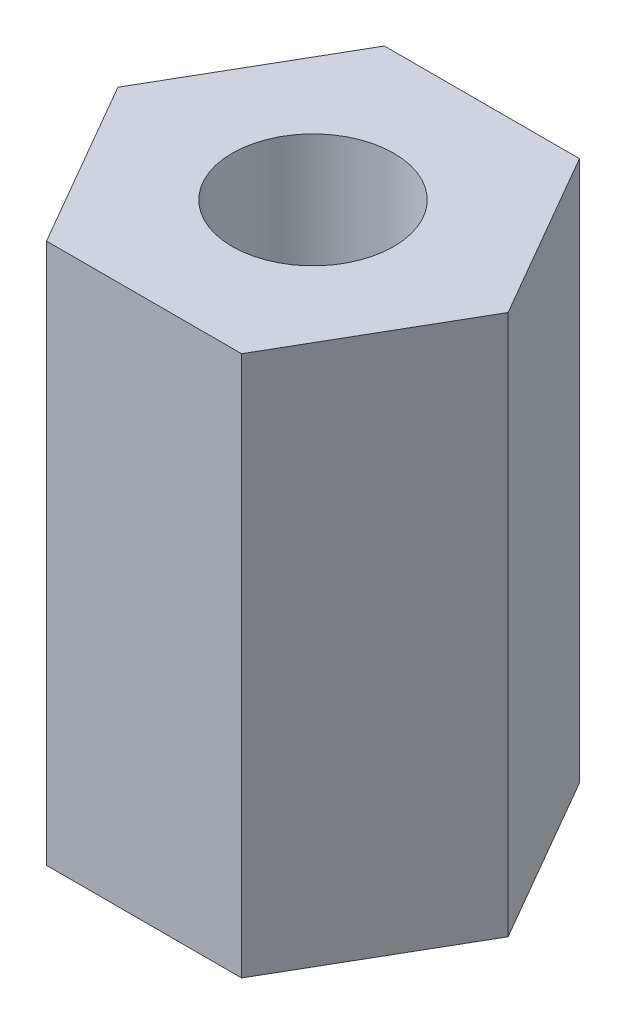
ISO-10303-21;
HEADER;
FILE_DESCRIPTION(('STEP AP214'),'2;1');
FILE_NAME('part.step','',(''),(''),'','','');
FILE_SCHEMA(('AUTOMOTIVE_DESIGN { 1 0 10303 214 1 1 1 1 }'));
ENDSEC;
DATA;
#1=APPLICATION_CONTEXT('core data for automotive mechanical design processes');
#2=APPLICATION_PROTOCOL_DEFINITION('international standard','automotive_design',2000,#1);
#3=PRODUCT_CONTEXT('',#1,'mechanical');
#4=PRODUCT('Part','Part','',(#3));
#5=PRODUCT_RELATED_PRODUCT_CATEGORY('part','',(#4));
#6=PRODUCT_DEFINITION_FORMATION('','',#4);
#7=PRODUCT_DEFINITION_CONTEXT('part definition',#1,'design');
#8=PRODUCT_DEFINITION('design','',#6,#7);
#9=PRODUCT_DEFINITION_SHAPE('','',#8);
#10=(LENGTH_UNIT() NAMED_UNIT(*) SI_UNIT(.MILLI.,.METRE.));
#11=(NAMED_UNIT(*) PLANE_ANGLE_UNIT() SI_UNIT($,.RADIAN.));
#12=(NAMED_UNIT(*) SI_UNIT($,.STERADIAN.) SOLID_ANGLE_UNIT());
#13=UNCERTAINTY_MEASURE_WITH_UNIT(LENGTH_MEASURE(1.E-05),#10,'distance_accuracy_value','');
#14=(GEOMETRIC_REPRESENTATION_CONTEXT(3) GLOBAL_UNCERTAINTY_ASSIGNED_CONTEXT((#13)) GLOBAL_UNIT_ASSIGNED_CONTEXT((#10,
#11,#12)) REPRESENTATION_CONTEXT('',''));
#15=CARTESIAN_POINT('',(0.,0.,0.));
#16=DIRECTION('',(0.,0.,1.));
#17=DIRECTION('',(1.,0.,0.));
#18=AXIS2_PLACEMENT_3D('',#15,#16,#17);
#19=CARTESIAN_POINT('',(-4.58271776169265,12.7,0.));
#20=DIRECTION('',(0.866025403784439,0.,0.5));
#21=DIRECTION('',(0.5,0.,-0.866025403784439));
#22=AXIS2_PLACEMENT_3D('',#19,#20,#21);
#23=PLANE('',#22);
#24=DIRECTION('',(-0.5,0.,0.866025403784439));
#25=VECTOR('',#24,1.);
#26=CARTESIAN_POINT('',(-4.58271776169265,0.,0.));
#27=LINE('',#26,#25);
#28=CARTESIAN_POINT('',(-2.29135888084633,0.,-3.96875));
#29=VERTEX_POINT('',#28);
#30=CARTESIAN_POINT('',(-4.58271776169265,0.,0.));
#31=VERTEX_POINT('',#30);
#32=EDGE_CURVE('E119',#29,#31,#27,.T.);
#33=ORIENTED_EDGE('',*,*,#32,.T.);
#34=DIRECTION('',(0.,-1.,0.));
#35=VECTOR('',#34,1.);
#36=CARTESIAN_POINT('',(-4.58271776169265,12.7,0.));
#37=LINE('',#36,#35);
#38=CARTESIAN_POINT('',(-4.58271776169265,12.7,0.));
#39=VERTEX_POINT('',#38);
#40=EDGE_CURVE('E11',#39,#31,#37,.T.);
#41=ORIENTED_EDGE('',*,*,#40,.F.);
#42=DIRECTION('',(-0.5,0.,0.866025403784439));
#43=VECTOR('',#42,1.);
#44=CARTESIAN_POINT('',(-4.58271776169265,12.7,0.));
#45=LINE('',#44,#43);
#46=CARTESIAN_POINT('',(-2.29135888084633,12.7,-3.96875));
#47=VERTEX_POINT('',#46);
#48=EDGE_CURVE('E130',#47,#39,#45,.T.);
#49=ORIENTED_EDGE('',*,*,#48,.F.);
#50=DIRECTION('',(0.,-1.,0.));
#51=VECTOR('',#50,1.);
#52=CARTESIAN_POINT('',(-2.29135888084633,12.7,-3.96875));
#53=LINE('',#52,#51);
#54=EDGE_CURVE('E115',#47,#29,#53,.T.);
#55=ORIENTED_EDGE('',*,*,#54,.T.);
#56=EDGE_LOOP('',(#33,#41,#49,#55));
#57=FACE_BOUND('',#56,.T.);
#58=ADVANCED_FACE('F35',(#57),#23,.F.);
#59=CARTESIAN_POINT('',(-2.29135888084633,12.7,3.96875));
#60=DIRECTION('',(0.866025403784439,0.,-0.5));
#61=DIRECTION('',(-0.5,0.,-0.866025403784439));
#62=AXIS2_PLACEMENT_3D('',#59,#60,#61);
#63=PLANE('',#62);
#64=DIRECTION('',(0.5,0.,0.866025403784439));
#65=VECTOR('',#64,1.);
#66=CARTESIAN_POINT('',(-2.29135888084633,0.,3.96875));
#67=LINE('',#66,#65);
#68=CARTESIAN_POINT('',(-2.29135888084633,0.,3.96875));
#69=VERTEX_POINT('',#68);
#70=EDGE_CURVE('E122',#31,#69,#67,.T.);
#71=ORIENTED_EDGE('',*,*,#70,.T.);
#72=DIRECTION('',(0.,-1.,0.));
#73=VECTOR('',#72,1.);
#74=CARTESIAN_POINT('',(-2.29135888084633,12.7,3.96875));
#75=LINE('',#74,#73);
#76=CARTESIAN_POINT('',(-2.29135888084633,12.7,3.96875));
#77=VERTEX_POINT('',#76);
#78=EDGE_CURVE('E43',#77,#69,#75,.T.);
#79=ORIENTED_EDGE('',*,*,#78,.F.);
#80=DIRECTION('',(0.5,0.,0.866025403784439));
#81=VECTOR('',#80,1.);
#82=CARTESIAN_POINT('',(-2.29135888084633,12.7,3.96875));
#83=LINE('',#82,#81);
#84=EDGE_CURVE('E88',#39,#77,#83,.T.);
#85=ORIENTED_EDGE('',*,*,#84,.F.);
#86=ORIENTED_EDGE('',*,*,#40,.T.);
#87=EDGE_LOOP('',(#71,#79,#85,#86));
#88=FACE_BOUND('',#87,.T.);
#89=ADVANCED_FACE('F155',(#88),#63,.F.);
#90=CARTESIAN_POINT('',(2.29135888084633,12.7,3.96875));
#91=DIRECTION('',(0.,0.,-1.));
#92=DIRECTION('',(-1.,0.,0.));
#93=AXIS2_PLACEMENT_3D('',#90,#91,#92);
#94=PLANE('',#93);
#95=DIRECTION('',(1.,0.,0.));
#96=VECTOR('',#95,1.);
#97=CARTESIAN_POINT('',(2.29135888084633,0.,3.96875));
#98=LINE('',#97,#96);
#99=CARTESIAN_POINT('',(2.29135888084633,0.,3.96875));
#100=VERTEX_POINT('',#99);
#101=EDGE_CURVE('E125',#69,#100,#98,.T.);
#102=ORIENTED_EDGE('',*,*,#101,.T.);
#103=DIRECTION('',(0.,-1.,0.));
#104=VECTOR('',#103,1.);
#105=CARTESIAN_POINT('',(2.29135888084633,12.7,3.96875));
#106=LINE('',#105,#104);
#107=CARTESIAN_POINT('',(2.29135888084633,12.7,3.96875));
#108=VERTEX_POINT('',#107);
#109=EDGE_CURVE('E110',#108,#100,#106,.T.);
#110=ORIENTED_EDGE('',*,*,#109,.F.);
#111=DIRECTION('',(1.,0.,0.));
#112=VECTOR('',#111,1.);
#113=CARTESIAN_POINT('',(2.29135888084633,12.7,3.96875));
#114=LINE('',#113,#112);
#115=EDGE_CURVE('E101',#77,#108,#114,.T.);
#116=ORIENTED_EDGE('',*,*,#115,.F.);
#117=ORIENTED_EDGE('',*,*,#78,.T.);
#118=EDGE_LOOP('',(#102,#110,#116,#117));
#119=FACE_BOUND('',#118,.T.);
#120=ADVANCED_FACE('F136',(#119),#94,.F.);
#121=CARTESIAN_POINT('',(4.58271776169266,12.7,0.));
#122=DIRECTION('',(-0.866025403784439,0.,-0.5));
#123=DIRECTION('',(-0.5,0.,0.866025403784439));
#124=AXIS2_PLACEMENT_3D('',#121,#122,#123);
#125=PLANE('',#124);
#126=DIRECTION('',(0.5,0.,-0.866025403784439));
#127=VECTOR('',#126,1.);
#128=CARTESIAN_POINT('',(4.58271776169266,0.,0.));
#129=LINE('',#128,#127);
#130=CARTESIAN_POINT('',(4.58271776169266,0.,0.));
#131=VERTEX_POINT('',#130);
#132=EDGE_CURVE('E109',#100,#131,#129,.T.);
#133=ORIENTED_EDGE('',*,*,#132,.T.);
#134=DIRECTION('',(0.,-1.,0.));
#135=VECTOR('',#134,1.);
#136=CARTESIAN_POINT('',(4.58271776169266,12.7,0.));
#137=LINE('',#136,#135);
#138=CARTESIAN_POINT('',(4.58271776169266,12.7,0.));
#139=VERTEX_POINT('',#138);
#140=EDGE_CURVE('E106',#139,#131,#137,.T.);
#141=ORIENTED_EDGE('',*,*,#140,.F.);
#142=DIRECTION('',(0.5,0.,-0.866025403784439));
#143=VECTOR('',#142,1.);
#144=CARTESIAN_POINT('',(4.58271776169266,12.7,0.));
#145=LINE('',#144,#143);
#146=EDGE_CURVE('E95',#108,#139,#145,.T.);
#147=ORIENTED_EDGE('',*,*,#146,.F.);
#148=ORIENTED_EDGE('',*,*,#109,.T.);
#149=EDGE_LOOP('',(#133,#141,#147,#148));
#150=FACE_BOUND('',#149,.T.);
#151=ADVANCED_FACE('F107',(#150),#125,.F.);
#152=CARTESIAN_POINT('',(2.29135888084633,12.7,-3.96875));
#153=DIRECTION('',(-0.866025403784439,0.,0.5));
#154=DIRECTION('',(0.5,0.,0.866025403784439));
#155=AXIS2_PLACEMENT_3D('',#152,#153,#154);
#156=PLANE('',#155);
#157=DIRECTION('',(-0.5,0.,-0.866025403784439));
#158=VECTOR('',#157,1.);
#159=CARTESIAN_POINT('',(2.29135888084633,0.,-3.96875));
#160=LINE('',#159,#158);
#161=CARTESIAN_POINT('',(2.29135888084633,0.,-3.96875));
#162=VERTEX_POINT('',#161);
#163=EDGE_CURVE('E74',#131,#162,#160,.T.);
#164=ORIENTED_EDGE('',*,*,#163,.T.);
#165=DIRECTION('',(0.,-1.,0.));
#166=VECTOR('',#165,1.);
#167=CARTESIAN_POINT('',(2.29135888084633,12.7,-3.96875));
#168=LINE('',#167,#166);
#169=CARTESIAN_POINT('',(2.29135888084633,12.7,-3.96875));
#170=VERTEX_POINT('',#169);
#171=EDGE_CURVE('E111',#170,#162,#168,.T.);
#172=ORIENTED_EDGE('',*,*,#171,.F.);
#173=DIRECTION('',(-0.5,0.,-0.866025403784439));
#174=VECTOR('',#173,1.);
#175=CARTESIAN_POINT('',(2.29135888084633,12.7,-3.96875));
#176=LINE('',#175,#174);
#177=EDGE_CURVE('E99',#139,#170,#176,.T.);
#178=ORIENTED_EDGE('',*,*,#177,.F.);
#179=ORIENTED_EDGE('',*,*,#140,.T.);
#180=EDGE_LOOP('',(#164,#172,#178,#179));
#181=FACE_BOUND('',#180,.T.);
#182=ADVANCED_FACE('F113',(#181),#156,.F.);
#183=CARTESIAN_POINT('',(-2.29135888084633,12.7,-3.96875));
#184=DIRECTION('',(0.,0.,1.));
#185=DIRECTION('',(1.,0.,0.));
#186=AXIS2_PLACEMENT_3D('',#183,#184,#185);
#187=PLANE('',#186);
#188=DIRECTION('',(-1.,0.,0.));
#189=VECTOR('',#188,1.);
#190=CARTESIAN_POINT('',(-2.29135888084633,0.,-3.96875));
#191=LINE('',#190,#189);
#192=EDGE_CURVE('E80',#162,#29,#191,.T.);
#193=ORIENTED_EDGE('',*,*,#192,.T.);
#194=ORIENTED_EDGE('',*,*,#54,.F.);
#195=DIRECTION('',(-1.,0.,0.));
#196=VECTOR('',#195,1.);
#197=CARTESIAN_POINT('',(-2.29135888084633,12.7,-3.96875));
#198=LINE('',#197,#196);
#199=EDGE_CURVE('E51',#170,#47,#198,.T.);
#200=ORIENTED_EDGE('',*,*,#199,.F.);
#201=ORIENTED_EDGE('',*,*,#171,.T.);
#202=EDGE_LOOP('',(#193,#194,#200,#201));
#203=FACE_BOUND('',#202,.T.);
#204=ADVANCED_FACE('F143',(#203),#187,.F.);
#205=CARTESIAN_POINT('',(0.,12.7,0.));
#206=DIRECTION('',(0.,-1.,0.));
#207=DIRECTION('',(0.,0.,-1.));
#208=AXIS2_PLACEMENT_3D('',#205,#206,#207);
#209=PLANE('',#208);
#210=CARTESIAN_POINT('',(0.,12.7,0.));
#211=DIRECTION('',(0.,1.,0.));
#212=DIRECTION('',(0.,0.,1.));
#213=AXIS2_PLACEMENT_3D('',#210,#211,#212);
#214=CIRCLE('',#213,1.89865);
#215=CARTESIAN_POINT('',(0.,12.7,1.89865));
#216=VERTEX_POINT('',#215);
#217=EDGE_CURVE('E210',#216,#216,#214,.T.);
#218=ORIENTED_EDGE('',*,*,#217,.F.);
#219=EDGE_LOOP('',(#218));
#220=FACE_BOUND('',#219,.T.);
#221=ORIENTED_EDGE('',*,*,#48,.T.);
#222=ORIENTED_EDGE('',*,*,#84,.T.);
#223=ORIENTED_EDGE('',*,*,#115,.T.);
#224=ORIENTED_EDGE('',*,*,#146,.T.);
#225=ORIENTED_EDGE('',*,*,#177,.T.);
#226=ORIENTED_EDGE('',*,*,#199,.T.);
#227=EDGE_LOOP('',(#221,#222,#223,#224,#225,#226));
#228=FACE_BOUND('',#227,.T.);
#229=ADVANCED_FACE('F97',(#220,#228),#209,.F.);
#230=CARTESIAN_POINT('',(0.,0.,0.));
#231=DIRECTION('',(0.,-1.,0.));
#232=DIRECTION('',(0.,0.,-1.));
#233=AXIS2_PLACEMENT_3D('',#230,#231,#232);
#234=PLANE('',#233);
#235=CARTESIAN_POINT('',(0.,0.,0.));
#236=DIRECTION('',(0.,1.,0.));
#237=DIRECTION('',(0.,0.,1.));
#238=AXIS2_PLACEMENT_3D('',#235,#236,#237);
#239=CIRCLE('',#238,1.89865);
#240=CARTESIAN_POINT('',(0.,0.,1.89865));
#241=VERTEX_POINT('',#240);
#242=EDGE_CURVE('E123',#241,#241,#239,.T.);
#243=ORIENTED_EDGE('',*,*,#242,.T.);
#244=EDGE_LOOP('',(#243));
#245=FACE_BOUND('',#244,.T.);
#246=ORIENTED_EDGE('',*,*,#32,.F.);
#247=ORIENTED_EDGE('',*,*,#192,.F.);
#248=ORIENTED_EDGE('',*,*,#163,.F.);
#249=ORIENTED_EDGE('',*,*,#132,.F.);
#250=ORIENTED_EDGE('',*,*,#101,.F.);
#251=ORIENTED_EDGE('',*,*,#70,.F.);
#252=EDGE_LOOP('',(#246,#247,#248,#249,#250,#251));
#253=FACE_BOUND('',#252,.T.);
#254=ADVANCED_FACE('F139',(#245,#253),#234,.T.);
#255=CARTESIAN_POINT('',(0.,12.7,0.));
#256=DIRECTION('',(0.,1.,0.));
#257=DIRECTION('',(0.,0.,1.));
#258=AXIS2_PLACEMENT_3D('',#255,#256,#257);
#259=CYLINDRICAL_SURFACE('',#258,1.89865);
#260=ORIENTED_EDGE('',*,*,#242,.F.);
#261=EDGE_LOOP('',(#260));
#262=FACE_BOUND('',#261,.T.);
#263=ORIENTED_EDGE('',*,*,#217,.T.);
#264=EDGE_LOOP('',(#263));
#265=FACE_BOUND('',#264,.T.);
#266=ADVANCED_FACE('F192',(#262,#265),#259,.F.);
#267=CLOSED_SHELL('',(#58,#89,#120,#151,#182,#204,#229,#254,#266));
#268=MANIFOLD_SOLID_BREP('B2',#267);
#269=ADVANCED_BREP_SHAPE_REPRESENTATION('',(#18,#268),#14);
#270=SHAPE_DEFINITION_REPRESENTATION(#9,#269);
ENDSEC;
END-ISO-10303-21;
